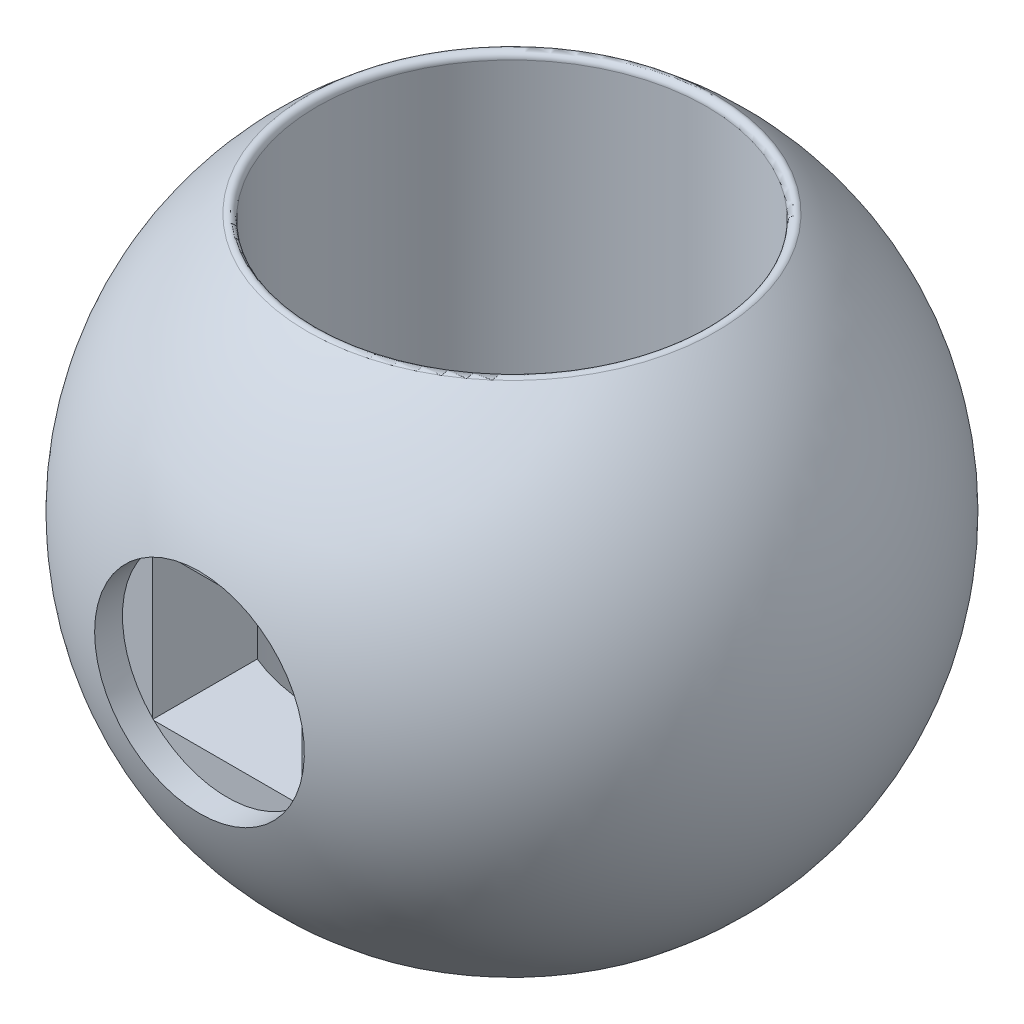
from build123d import *

# Parameters (mm, degrees)
CONG_SUP_ET_INF_R = 0.2
ESQUISSE2_R       = 3.5
ROND_DEPTH        = 2
ESQUISSE3_W       = 5
ESQUISSE3_H       = 5
CARR_DEPTH        = 11


with BuildPart() as part:
    # Esquisse1 → Base-R_volution (revolve)
    with BuildSketch(Plane.XY):
        with BuildLine():
            Line((6.5, -8.874119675), (6.5, 8.874119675))
            ThreePointArc((6.5, 8.874119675), (11, 0), (6.5, -8.874119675))
        make_face()
    revolve(axis=Axis((0, 0, 0), (0, 1, 0)))

    # Cong_ sup et inf
    cong_sup_et_inf_edges = [part.edges().sort_by_distance(p)[0] for p in [
        (-6.5, -8.874119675, 0),
        (-6.5, 8.874119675, 0),
    ]]
    fillet(cong_sup_et_inf_edges, radius=CONG_SUP_ET_INF_R)

    # Esquisse2 → Rond (cut)
    with BuildSketch(Plane.XY.offset(11.5)):
        Circle(ESQUISSE2_R)
    extrude(amount=-ROND_DEPTH, mode=Mode.SUBTRACT)

    # Esquisse3 → Carr (cut)
    with BuildSketch(Plane.XY.offset(9.5)):
        Rectangle(ESQUISSE3_W, ESQUISSE3_H)
    extrude(amount=-CARR_DEPTH, mode=Mode.SUBTRACT)


solid = part.part
